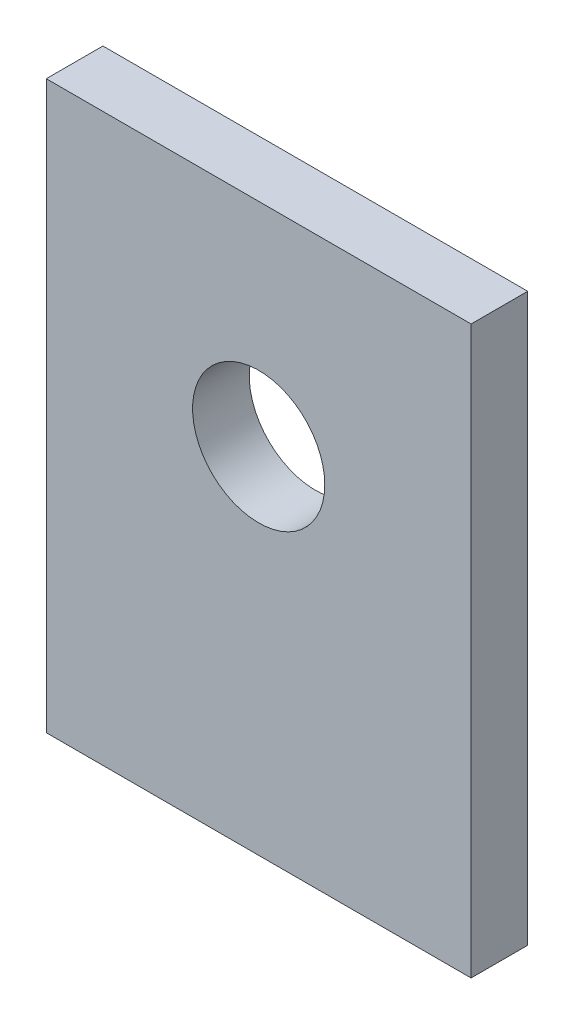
ISO-10303-21;
HEADER;
FILE_DESCRIPTION(('STEP AP214'),'2;1');
FILE_NAME('part.step','',(''),(''),'','','');
FILE_SCHEMA(('AUTOMOTIVE_DESIGN { 1 0 10303 214 1 1 1 1 }'));
ENDSEC;
DATA;
#1=APPLICATION_CONTEXT('core data for automotive mechanical design processes');
#2=APPLICATION_PROTOCOL_DEFINITION('international standard','automotive_design',2000,#1);
#3=PRODUCT_CONTEXT('',#1,'mechanical');
#4=PRODUCT('Part','Part','',(#3));
#5=PRODUCT_RELATED_PRODUCT_CATEGORY('part','',(#4));
#6=PRODUCT_DEFINITION_FORMATION('','',#4);
#7=PRODUCT_DEFINITION_CONTEXT('part definition',#1,'design');
#8=PRODUCT_DEFINITION('design','',#6,#7);
#9=PRODUCT_DEFINITION_SHAPE('','',#8);
#10=(LENGTH_UNIT() NAMED_UNIT(*) SI_UNIT(.MILLI.,.METRE.));
#11=(NAMED_UNIT(*) PLANE_ANGLE_UNIT() SI_UNIT($,.RADIAN.));
#12=(NAMED_UNIT(*) SI_UNIT($,.STERADIAN.) SOLID_ANGLE_UNIT());
#13=UNCERTAINTY_MEASURE_WITH_UNIT(LENGTH_MEASURE(1.E-05),#10,'distance_accuracy_value','');
#14=(GEOMETRIC_REPRESENTATION_CONTEXT(3) GLOBAL_UNCERTAINTY_ASSIGNED_CONTEXT((#13)) GLOBAL_UNIT_ASSIGNED_CONTEXT((#10,
#11,#12)) REPRESENTATION_CONTEXT('',''));
#15=CARTESIAN_POINT('',(0.,0.,0.));
#16=DIRECTION('',(0.,0.,1.));
#17=DIRECTION('',(1.,0.,0.));
#18=AXIS2_PLACEMENT_3D('',#15,#16,#17);
#19=CARTESIAN_POINT('',(0.,60.,12.));
#20=DIRECTION('',(0.,0.,1.));
#21=DIRECTION('',(1.,0.,0.));
#22=AXIS2_PLACEMENT_3D('',#19,#20,#21);
#23=PLANE('',#22);
#24=CARTESIAN_POINT('',(0.,75.,12.));
#25=DIRECTION('',(0.,0.,1.));
#26=DIRECTION('',(1.,0.,0.));
#27=AXIS2_PLACEMENT_3D('',#24,#25,#26);
#28=CIRCLE('',#27,14.);
#29=CARTESIAN_POINT('',(14.,75.,12.));
#30=VERTEX_POINT('',#29);
#31=EDGE_CURVE('E24',#30,#30,#28,.T.);
#32=ORIENTED_EDGE('',*,*,#31,.F.);
#33=EDGE_LOOP('',(#32));
#34=FACE_BOUND('',#33,.T.);
#35=DIRECTION('',(1.,0.,0.));
#36=VECTOR('',#35,1.);
#37=CARTESIAN_POINT('',(-45.,0.,12.));
#38=LINE('',#37,#36);
#39=CARTESIAN_POINT('',(-45.,0.,12.));
#40=VERTEX_POINT('',#39);
#41=CARTESIAN_POINT('',(45.,0.,12.));
#42=VERTEX_POINT('',#41);
#43=EDGE_CURVE('E96',#40,#42,#38,.T.);
#44=ORIENTED_EDGE('',*,*,#43,.T.);
#45=DIRECTION('',(0.,1.,0.));
#46=VECTOR('',#45,1.);
#47=CARTESIAN_POINT('',(45.,0.,12.));
#48=LINE('',#47,#46);
#49=CARTESIAN_POINT('',(45.,120.,12.));
#50=VERTEX_POINT('',#49);
#51=EDGE_CURVE('E111',#42,#50,#48,.T.);
#52=ORIENTED_EDGE('',*,*,#51,.T.);
#53=DIRECTION('',(-1.,0.,0.));
#54=VECTOR('',#53,1.);
#55=CARTESIAN_POINT('',(45.,120.,12.));
#56=LINE('',#55,#54);
#57=CARTESIAN_POINT('',(-45.,120.,12.));
#58=VERTEX_POINT('',#57);
#59=EDGE_CURVE('E88',#50,#58,#56,.T.);
#60=ORIENTED_EDGE('',*,*,#59,.T.);
#61=DIRECTION('',(0.,-1.,0.));
#62=VECTOR('',#61,1.);
#63=CARTESIAN_POINT('',(-45.,120.,12.));
#64=LINE('',#63,#62);
#65=EDGE_CURVE('E87',#58,#40,#64,.T.);
#66=ORIENTED_EDGE('',*,*,#65,.T.);
#67=EDGE_LOOP('',(#44,#52,#60,#66));
#68=FACE_BOUND('',#67,.T.);
#69=ADVANCED_FACE('F16',(#34,#68),#23,.T.);
#70=CARTESIAN_POINT('',(0.,60.,0.));
#71=DIRECTION('',(0.,0.,1.));
#72=DIRECTION('',(1.,0.,0.));
#73=AXIS2_PLACEMENT_3D('',#70,#71,#72);
#74=PLANE('',#73);
#75=CARTESIAN_POINT('',(0.,75.,0.));
#76=DIRECTION('',(0.,0.,1.));
#77=DIRECTION('',(1.,0.,0.));
#78=AXIS2_PLACEMENT_3D('',#75,#76,#77);
#79=CIRCLE('',#78,14.);
#80=CARTESIAN_POINT('',(14.,75.,0.));
#81=VERTEX_POINT('',#80);
#82=EDGE_CURVE('E10',#81,#81,#79,.T.);
#83=ORIENTED_EDGE('',*,*,#82,.T.);
#84=EDGE_LOOP('',(#83));
#85=FACE_BOUND('',#84,.T.);
#86=DIRECTION('',(0.,-1.,0.));
#87=VECTOR('',#86,1.);
#88=CARTESIAN_POINT('',(-45.,120.,0.));
#89=LINE('',#88,#87);
#90=CARTESIAN_POINT('',(-45.,120.,0.));
#91=VERTEX_POINT('',#90);
#92=CARTESIAN_POINT('',(-45.,0.,0.));
#93=VERTEX_POINT('',#92);
#94=EDGE_CURVE('E76',#91,#93,#89,.T.);
#95=ORIENTED_EDGE('',*,*,#94,.F.);
#96=DIRECTION('',(-1.,0.,0.));
#97=VECTOR('',#96,1.);
#98=CARTESIAN_POINT('',(45.,120.,0.));
#99=LINE('',#98,#97);
#100=CARTESIAN_POINT('',(45.,120.,0.));
#101=VERTEX_POINT('',#100);
#102=EDGE_CURVE('E113',#101,#91,#99,.T.);
#103=ORIENTED_EDGE('',*,*,#102,.F.);
#104=DIRECTION('',(0.,1.,0.));
#105=VECTOR('',#104,1.);
#106=CARTESIAN_POINT('',(45.,0.,0.));
#107=LINE('',#106,#105);
#108=CARTESIAN_POINT('',(45.,0.,0.));
#109=VERTEX_POINT('',#108);
#110=EDGE_CURVE('E98',#109,#101,#107,.T.);
#111=ORIENTED_EDGE('',*,*,#110,.F.);
#112=DIRECTION('',(1.,0.,0.));
#113=VECTOR('',#112,1.);
#114=CARTESIAN_POINT('',(-45.,0.,0.));
#115=LINE('',#114,#113);
#116=EDGE_CURVE('E94',#93,#109,#115,.T.);
#117=ORIENTED_EDGE('',*,*,#116,.F.);
#118=EDGE_LOOP('',(#95,#103,#111,#117));
#119=FACE_BOUND('',#118,.T.);
#120=ADVANCED_FACE('F100',(#85,#119),#74,.F.);
#121=CARTESIAN_POINT('',(0.,75.,0.));
#122=DIRECTION('',(0.,0.,-1.));
#123=DIRECTION('',(1.,0.,0.));
#124=AXIS2_PLACEMENT_3D('',#121,#122,#123);
#125=CYLINDRICAL_SURFACE('',#124,14.);
#126=DIRECTION('',(0.,0.,1.));
#127=VECTOR('',#126,1.);
#128=CARTESIAN_POINT('',(14.,75.,0.));
#129=LINE('',#128,#127);
#130=EDGE_CURVE('E125',#81,#30,#129,.T.);
#131=ORIENTED_EDGE('',*,*,#130,.T.);
#132=ORIENTED_EDGE('',*,*,#31,.T.);
#133=ORIENTED_EDGE('',*,*,#130,.F.);
#134=ORIENTED_EDGE('',*,*,#82,.F.);
#135=EDGE_LOOP('',(#131,#132,#133,#134));
#136=FACE_BOUND('',#135,.T.);
#137=ADVANCED_FACE('F136',(#136),#125,.F.);
#138=CARTESIAN_POINT('',(-45.,120.,0.));
#139=DIRECTION('',(1.,0.,0.));
#140=DIRECTION('',(0.,1.,0.));
#141=AXIS2_PLACEMENT_3D('',#138,#139,#140);
#142=PLANE('',#141);
#143=ORIENTED_EDGE('',*,*,#94,.T.);
#144=DIRECTION('',(0.,0.,1.));
#145=VECTOR('',#144,1.);
#146=CARTESIAN_POINT('',(-45.,0.,0.));
#147=LINE('',#146,#145);
#148=EDGE_CURVE('E79',#93,#40,#147,.T.);
#149=ORIENTED_EDGE('',*,*,#148,.T.);
#150=ORIENTED_EDGE('',*,*,#65,.F.);
#151=DIRECTION('',(0.,0.,1.));
#152=VECTOR('',#151,1.);
#153=CARTESIAN_POINT('',(-45.,120.,0.));
#154=LINE('',#153,#152);
#155=EDGE_CURVE('E82',#91,#58,#154,.T.);
#156=ORIENTED_EDGE('',*,*,#155,.F.);
#157=EDGE_LOOP('',(#143,#149,#150,#156));
#158=FACE_BOUND('',#157,.T.);
#159=ADVANCED_FACE('F78',(#158),#142,.F.);
#160=CARTESIAN_POINT('',(45.,120.,0.));
#161=DIRECTION('',(0.,-1.,0.));
#162=DIRECTION('',(0.,0.,-1.));
#163=AXIS2_PLACEMENT_3D('',#160,#161,#162);
#164=PLANE('',#163);
#165=ORIENTED_EDGE('',*,*,#102,.T.);
#166=ORIENTED_EDGE('',*,*,#155,.T.);
#167=ORIENTED_EDGE('',*,*,#59,.F.);
#168=DIRECTION('',(0.,0.,1.));
#169=VECTOR('',#168,1.);
#170=CARTESIAN_POINT('',(45.,120.,0.));
#171=LINE('',#170,#169);
#172=EDGE_CURVE('E114',#101,#50,#171,.T.);
#173=ORIENTED_EDGE('',*,*,#172,.F.);
#174=EDGE_LOOP('',(#165,#166,#167,#173));
#175=FACE_BOUND('',#174,.T.);
#176=ADVANCED_FACE('F144',(#175),#164,.F.);
#177=CARTESIAN_POINT('',(45.,0.,0.));
#178=DIRECTION('',(-1.,0.,0.));
#179=DIRECTION('',(0.,0.,1.));
#180=AXIS2_PLACEMENT_3D('',#177,#178,#179);
#181=PLANE('',#180);
#182=ORIENTED_EDGE('',*,*,#110,.T.);
#183=ORIENTED_EDGE('',*,*,#172,.T.);
#184=ORIENTED_EDGE('',*,*,#51,.F.);
#185=DIRECTION('',(0.,0.,1.));
#186=VECTOR('',#185,1.);
#187=CARTESIAN_POINT('',(45.,0.,0.));
#188=LINE('',#187,#186);
#189=EDGE_CURVE('E104',#109,#42,#188,.T.);
#190=ORIENTED_EDGE('',*,*,#189,.F.);
#191=EDGE_LOOP('',(#182,#183,#184,#190));
#192=FACE_BOUND('',#191,.T.);
#193=ADVANCED_FACE('F152',(#192),#181,.F.);
#194=CARTESIAN_POINT('',(-45.,0.,0.));
#195=DIRECTION('',(0.,1.,0.));
#196=DIRECTION('',(1.,0.,0.));
#197=AXIS2_PLACEMENT_3D('',#194,#195,#196);
#198=PLANE('',#197);
#199=ORIENTED_EDGE('',*,*,#116,.T.);
#200=ORIENTED_EDGE('',*,*,#189,.T.);
#201=ORIENTED_EDGE('',*,*,#43,.F.);
#202=ORIENTED_EDGE('',*,*,#148,.F.);
#203=EDGE_LOOP('',(#199,#200,#201,#202));
#204=FACE_BOUND('',#203,.T.);
#205=ADVANCED_FACE('F92',(#204),#198,.F.);
#206=CLOSED_SHELL('',(#69,#120,#137,#159,#176,#193,#205));
#207=MANIFOLD_SOLID_BREP('B1',#206);
#208=ADVANCED_BREP_SHAPE_REPRESENTATION('',(#18,#207),#14);
#209=SHAPE_DEFINITION_REPRESENTATION(#9,#208);
ENDSEC;
END-ISO-10303-21;
